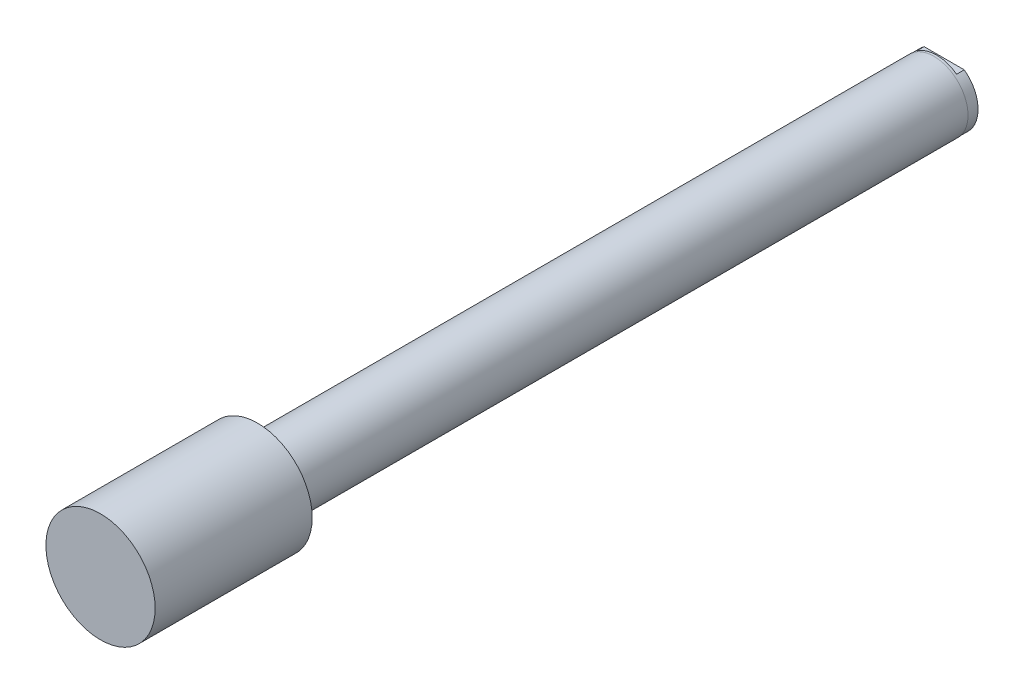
ISO-10303-21;
HEADER;
FILE_DESCRIPTION(('STEP AP214'),'2;1');
FILE_NAME('part.step','',(''),(''),'','','');
FILE_SCHEMA(('AUTOMOTIVE_DESIGN { 1 0 10303 214 1 1 1 1 }'));
ENDSEC;
DATA;
#1=APPLICATION_CONTEXT('core data for automotive mechanical design processes');
#2=APPLICATION_PROTOCOL_DEFINITION('international standard','automotive_design',2000,#1);
#3=PRODUCT_CONTEXT('',#1,'mechanical');
#4=PRODUCT('Part','Part','',(#3));
#5=PRODUCT_RELATED_PRODUCT_CATEGORY('part','',(#4));
#6=PRODUCT_DEFINITION_FORMATION('','',#4);
#7=PRODUCT_DEFINITION_CONTEXT('part definition',#1,'design');
#8=PRODUCT_DEFINITION('design','',#6,#7);
#9=PRODUCT_DEFINITION_SHAPE('','',#8);
#10=(LENGTH_UNIT() NAMED_UNIT(*) SI_UNIT(.MILLI.,.METRE.));
#11=(NAMED_UNIT(*) PLANE_ANGLE_UNIT() SI_UNIT($,.RADIAN.));
#12=(NAMED_UNIT(*) SI_UNIT($,.STERADIAN.) SOLID_ANGLE_UNIT());
#13=UNCERTAINTY_MEASURE_WITH_UNIT(LENGTH_MEASURE(1.E-05),#10,'distance_accuracy_value','');
#14=(GEOMETRIC_REPRESENTATION_CONTEXT(3) GLOBAL_UNCERTAINTY_ASSIGNED_CONTEXT((#13)) GLOBAL_UNIT_ASSIGNED_CONTEXT((#10,
#11,#12)) REPRESENTATION_CONTEXT('',''));
#15=CARTESIAN_POINT('',(0.,0.,0.));
#16=DIRECTION('',(0.,0.,1.));
#17=DIRECTION('',(1.,0.,0.));
#18=AXIS2_PLACEMENT_3D('',#15,#16,#17);
#19=CARTESIAN_POINT('',(0.,0.,27.7368));
#20=DIRECTION('',(0.,0.,-1.));
#21=DIRECTION('',(-1.,0.,0.));
#22=AXIS2_PLACEMENT_3D('',#19,#20,#21);
#23=CONICAL_SURFACE('',#22,4.96062,1.02974425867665);
#24=CARTESIAN_POINT('',(0.,0.,30.7174412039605));
#25=VERTEX_POINT('',#24);
#26=VERTEX_LOOP('',#25);
#27=FACE_BOUND('',#26,.T.);
#28=CARTESIAN_POINT('',(0.,0.,27.7368));
#29=DIRECTION('',(0.,0.,-1.));
#30=DIRECTION('',(-1.,0.,0.));
#31=AXIS2_PLACEMENT_3D('',#28,#29,#30);
#32=CIRCLE('',#31,4.96062);
#33=CARTESIAN_POINT('',(-4.96062,0.,27.7368));
#34=VERTEX_POINT('',#33);
#35=EDGE_CURVE('E93',#34,#34,#32,.T.);
#36=ORIENTED_EDGE('',*,*,#35,.T.);
#37=EDGE_LOOP('',(#36));
#38=FACE_BOUND('',#37,.T.);
#39=ADVANCED_FACE('F16',(#27,#38),#23,.F.);
#40=CARTESIAN_POINT('',(0.,0.,-4.7752));
#41=DIRECTION('',(0.,0.,-1.));
#42=DIRECTION('',(-1.,0.,0.));
#43=AXIS2_PLACEMENT_3D('',#40,#41,#42);
#44=CYLINDRICAL_SURFACE('',#43,4.96062);
#45=ORIENTED_EDGE('',*,*,#35,.F.);
#46=EDGE_LOOP('',(#45));
#47=FACE_BOUND('',#46,.T.);
#48=CARTESIAN_POINT('',(0.,0.,-4.7752));
#49=DIRECTION('',(0.,0.,-1.));
#50=DIRECTION('',(-1.,0.,0.));
#51=AXIS2_PLACEMENT_3D('',#48,#49,#50);
#52=CIRCLE('',#51,4.96062);
#53=CARTESIAN_POINT('',(-4.96062,0.,-4.7752));
#54=VERTEX_POINT('',#53);
#55=EDGE_CURVE('E97',#54,#54,#52,.T.);
#56=ORIENTED_EDGE('',*,*,#55,.T.);
#57=EDGE_LOOP('',(#56));
#58=FACE_BOUND('',#57,.T.);
#59=ADVANCED_FACE('F131',(#47,#58),#44,.F.);
#60=CARTESIAN_POINT('',(0.,0.,-1.2192));
#61=DIRECTION('',(0.,0.,-1.));
#62=DIRECTION('',(-1.,0.,0.));
#63=AXIS2_PLACEMENT_3D('',#60,#61,#62);
#64=PLANE('',#63);
#65=CARTESIAN_POINT('',(0.,0.,-1.2192));
#66=DIRECTION('',(0.,0.,-1.));
#67=DIRECTION('',(-1.,0.,0.));
#68=AXIS2_PLACEMENT_3D('',#65,#66,#67);
#69=CIRCLE('',#68,15.7607);
#70=CARTESIAN_POINT('',(9.33325583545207,-12.7,-1.2192));
#71=VERTEX_POINT('',#70);
#72=CARTESIAN_POINT('',(-9.33325583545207,-12.7,-1.2192));
#73=VERTEX_POINT('',#72);
#74=EDGE_CURVE('E65',#71,#73,#69,.T.);
#75=ORIENTED_EDGE('',*,*,#74,.T.);
#76=DIRECTION('',(1.,0.,0.));
#77=VECTOR('',#76,1.);
#78=CARTESIAN_POINT('',(9.33325583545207,-12.7,-1.2192));
#79=LINE('',#78,#77);
#80=EDGE_CURVE('E67',#73,#71,#79,.T.);
#81=ORIENTED_EDGE('',*,*,#80,.T.);
#82=EDGE_LOOP('',(#75,#81));
#83=FACE_BOUND('',#82,.T.);
#84=ADVANCED_FACE('F66',(#83),#64,.T.);
#85=CARTESIAN_POINT('',(0.,0.,-1.2192));
#86=DIRECTION('',(0.,0.,-1.));
#87=DIRECTION('',(-1.,0.,0.));
#88=AXIS2_PLACEMENT_3D('',#85,#86,#87);
#89=PLANE('',#88);
#90=CARTESIAN_POINT('',(0.,0.,-1.2192));
#91=DIRECTION('',(0.,0.,-1.));
#92=DIRECTION('',(-1.,0.,0.));
#93=AXIS2_PLACEMENT_3D('',#90,#91,#92);
#94=CIRCLE('',#93,15.7607);
#95=CARTESIAN_POINT('',(-9.33325583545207,12.7,-1.2192));
#96=VERTEX_POINT('',#95);
#97=CARTESIAN_POINT('',(9.33325583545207,12.7,-1.2192));
#98=VERTEX_POINT('',#97);
#99=EDGE_CURVE('E85',#96,#98,#94,.T.);
#100=ORIENTED_EDGE('',*,*,#99,.T.);
#101=DIRECTION('',(-1.,0.,0.));
#102=VECTOR('',#101,1.);
#103=CARTESIAN_POINT('',(9.33325583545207,12.7,-1.2192));
#104=LINE('',#103,#102);
#105=EDGE_CURVE('E87',#98,#96,#104,.T.);
#106=ORIENTED_EDGE('',*,*,#105,.T.);
#107=EDGE_LOOP('',(#100,#106));
#108=FACE_BOUND('',#107,.T.);
#109=ADVANCED_FACE('F121',(#108),#89,.T.);
#110=CARTESIAN_POINT('',(9.33325583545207,12.7,-1.2192));
#111=DIRECTION('',(0.,-1.,0.));
#112=DIRECTION('',(0.,0.,1.));
#113=AXIS2_PLACEMENT_3D('',#110,#111,#112);
#114=PLANE('',#113);
#115=DIRECTION('',(-1.,0.,0.));
#116=VECTOR('',#115,1.);
#117=CARTESIAN_POINT('',(9.33325583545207,12.7,-4.7752));
#118=LINE('',#117,#116);
#119=CARTESIAN_POINT('',(9.33325583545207,12.7,-4.7752));
#120=VERTEX_POINT('',#119);
#121=CARTESIAN_POINT('',(-9.33325583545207,12.7,-4.7752));
#122=VERTEX_POINT('',#121);
#123=EDGE_CURVE('E81',#120,#122,#118,.T.);
#124=ORIENTED_EDGE('',*,*,#123,.T.);
#125=DIRECTION('',(0.,0.,-1.));
#126=VECTOR('',#125,1.);
#127=CARTESIAN_POINT('',(-9.33325583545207,12.7,-1.2192));
#128=LINE('',#127,#126);
#129=EDGE_CURVE('E91',#96,#122,#128,.T.);
#130=ORIENTED_EDGE('',*,*,#129,.F.);
#131=ORIENTED_EDGE('',*,*,#105,.F.);
#132=DIRECTION('',(0.,0.,-1.));
#133=VECTOR('',#132,1.);
#134=CARTESIAN_POINT('',(9.33325583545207,12.7,-1.2192));
#135=LINE('',#134,#133);
#136=EDGE_CURVE('E41',#98,#120,#135,.T.);
#137=ORIENTED_EDGE('',*,*,#136,.T.);
#138=EDGE_LOOP('',(#124,#130,#131,#137));
#139=FACE_BOUND('',#138,.T.);
#140=ADVANCED_FACE('F118',(#139),#114,.F.);
#141=CARTESIAN_POINT('',(0.,0.,-4.7752));
#142=DIRECTION('',(0.,0.,-1.));
#143=DIRECTION('',(-1.,0.,0.));
#144=AXIS2_PLACEMENT_3D('',#141,#142,#143);
#145=PLANE('',#144);
#146=DIRECTION('',(1.,0.,0.));
#147=VECTOR('',#146,1.);
#148=CARTESIAN_POINT('',(9.33325583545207,-12.7,-4.7752));
#149=LINE('',#148,#147);
#150=CARTESIAN_POINT('',(-9.33325583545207,-12.7,-4.7752));
#151=VERTEX_POINT('',#150);
#152=CARTESIAN_POINT('',(9.33325583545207,-12.7,-4.7752));
#153=VERTEX_POINT('',#152);
#154=EDGE_CURVE('E70',#151,#153,#149,.T.);
#155=ORIENTED_EDGE('',*,*,#154,.F.);
#156=CARTESIAN_POINT('',(0.,0.,-4.7752));
#157=DIRECTION('',(0.,0.,-1.));
#158=DIRECTION('',(-1.,0.,0.));
#159=AXIS2_PLACEMENT_3D('',#156,#157,#158);
#160=CIRCLE('',#159,15.7607);
#161=EDGE_CURVE('E79',#151,#122,#160,.T.);
#162=ORIENTED_EDGE('',*,*,#161,.T.);
#163=ORIENTED_EDGE('',*,*,#123,.F.);
#164=EDGE_CURVE('E25',#120,#153,#160,.T.);
#165=ORIENTED_EDGE('',*,*,#164,.T.);
#166=EDGE_LOOP('',(#155,#162,#163,#165));
#167=FACE_BOUND('',#166,.T.);
#168=ORIENTED_EDGE('',*,*,#55,.F.);
#169=EDGE_LOOP('',(#168));
#170=FACE_BOUND('',#169,.T.);
#171=ADVANCED_FACE('F116',(#167,#170),#145,.T.);
#172=CARTESIAN_POINT('',(9.33325583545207,-12.7,-1.2192));
#173=DIRECTION('',(0.,1.,0.));
#174=DIRECTION('',(0.,0.,-1.));
#175=AXIS2_PLACEMENT_3D('',#172,#173,#174);
#176=PLANE('',#175);
#177=ORIENTED_EDGE('',*,*,#154,.T.);
#178=DIRECTION('',(0.,0.,-1.));
#179=VECTOR('',#178,1.);
#180=CARTESIAN_POINT('',(9.33325583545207,-12.7,-1.2192));
#181=LINE('',#180,#179);
#182=EDGE_CURVE('E73',#71,#153,#181,.T.);
#183=ORIENTED_EDGE('',*,*,#182,.F.);
#184=ORIENTED_EDGE('',*,*,#80,.F.);
#185=DIRECTION('',(0.,0.,-1.));
#186=VECTOR('',#185,1.);
#187=CARTESIAN_POINT('',(-9.33325583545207,-12.7,-1.2192));
#188=LINE('',#187,#186);
#189=EDGE_CURVE('E33',#73,#151,#188,.T.);
#190=ORIENTED_EDGE('',*,*,#189,.T.);
#191=EDGE_LOOP('',(#177,#183,#184,#190));
#192=FACE_BOUND('',#191,.T.);
#193=ADVANCED_FACE('F72',(#192),#176,.F.);
#194=CARTESIAN_POINT('',(0.,0.,0.));
#195=DIRECTION('',(0.,0.,-1.));
#196=DIRECTION('',(-1.,0.,0.));
#197=AXIS2_PLACEMENT_3D('',#194,#195,#196);
#198=CYLINDRICAL_SURFACE('',#197,15.7607);
#199=ORIENTED_EDGE('',*,*,#182,.T.);
#200=ORIENTED_EDGE('',*,*,#164,.F.);
#201=ORIENTED_EDGE('',*,*,#136,.F.);
#202=ORIENTED_EDGE('',*,*,#99,.F.);
#203=ORIENTED_EDGE('',*,*,#129,.T.);
#204=ORIENTED_EDGE('',*,*,#161,.F.);
#205=ORIENTED_EDGE('',*,*,#189,.F.);
#206=ORIENTED_EDGE('',*,*,#74,.F.);
#207=EDGE_LOOP('',(#199,#200,#201,#202,#203,#204,#205,#206));
#208=FACE_BOUND('',#207,.T.);
#209=CARTESIAN_POINT('',(0.,0.,0.));
#210=DIRECTION('',(0.,0.,-1.));
#211=DIRECTION('',(-1.,0.,0.));
#212=AXIS2_PLACEMENT_3D('',#209,#210,#211);
#213=CIRCLE('',#212,15.7607);
#214=CARTESIAN_POINT('',(-15.7607,0.,0.));
#215=VERTEX_POINT('',#214);
#216=EDGE_CURVE('E10',#215,#215,#213,.T.);
#217=ORIENTED_EDGE('',*,*,#216,.T.);
#218=EDGE_LOOP('',(#217));
#219=FACE_BOUND('',#218,.T.);
#220=ADVANCED_FACE('F76',(#208,#219),#198,.T.);
#221=CARTESIAN_POINT('',(0.,0.,387.5024));
#222=DIRECTION('',(0.,0.,1.));
#223=DIRECTION('',(1.,0.,0.));
#224=AXIS2_PLACEMENT_3D('',#221,#222,#223);
#225=PLANE('',#224);
#226=CARTESIAN_POINT('',(0.,0.,387.5024));
#227=DIRECTION('',(0.,0.,1.));
#228=DIRECTION('',(1.,0.,0.));
#229=AXIS2_PLACEMENT_3D('',#226,#227,#228);
#230=CIRCLE('',#229,25.4);
#231=CARTESIAN_POINT('',(25.4,0.,387.5024));
#232=VERTEX_POINT('',#231);
#233=EDGE_CURVE('E102',#232,#232,#230,.T.);
#234=ORIENTED_EDGE('',*,*,#233,.T.);
#235=EDGE_LOOP('',(#234));
#236=FACE_BOUND('',#235,.T.);
#237=ADVANCED_FACE('F149',(#236),#225,.T.);
#238=CARTESIAN_POINT('',(0.,0.,387.5024));
#239=DIRECTION('',(0.,0.,-1.));
#240=DIRECTION('',(-1.,0.,0.));
#241=AXIS2_PLACEMENT_3D('',#238,#239,#240);
#242=CYLINDRICAL_SURFACE('',#241,25.4);
#243=ORIENTED_EDGE('',*,*,#233,.F.);
#244=EDGE_LOOP('',(#243));
#245=FACE_BOUND('',#244,.T.);
#246=CARTESIAN_POINT('',(0.,0.,314.4774));
#247=DIRECTION('',(0.,0.,1.));
#248=DIRECTION('',(1.,0.,0.));
#249=AXIS2_PLACEMENT_3D('',#246,#247,#248);
#250=CIRCLE('',#249,25.4);
#251=CARTESIAN_POINT('',(25.4,0.,314.4774));
#252=VERTEX_POINT('',#251);
#253=EDGE_CURVE('E106',#252,#252,#250,.T.);
#254=ORIENTED_EDGE('',*,*,#253,.T.);
#255=EDGE_LOOP('',(#254));
#256=FACE_BOUND('',#255,.T.);
#257=ADVANCED_FACE('F152',(#245,#256),#242,.T.);
#258=CARTESIAN_POINT('',(0.,0.,314.4774));
#259=DIRECTION('',(0.,0.,1.));
#260=DIRECTION('',(1.,0.,0.));
#261=AXIS2_PLACEMENT_3D('',#258,#259,#260);
#262=PLANE('',#261);
#263=CARTESIAN_POINT('',(0.,0.,314.4774));
#264=DIRECTION('',(0.,0.,1.));
#265=DIRECTION('',(1.,0.,0.));
#266=AXIS2_PLACEMENT_3D('',#263,#264,#265);
#267=CIRCLE('',#266,15.875);
#268=CARTESIAN_POINT('',(15.875,0.,314.4774));
#269=VERTEX_POINT('',#268);
#270=EDGE_CURVE('E105',#269,#269,#267,.F.);
#271=ORIENTED_EDGE('',*,*,#270,.F.);
#272=EDGE_LOOP('',(#271));
#273=FACE_BOUND('',#272,.T.);
#274=ORIENTED_EDGE('',*,*,#253,.F.);
#275=EDGE_LOOP('',(#274));
#276=FACE_BOUND('',#275,.T.);
#277=ADVANCED_FACE('F154',(#273,#276),#262,.F.);
#278=CARTESIAN_POINT('',(0.,0.,314.4774));
#279=DIRECTION('',(0.,0.,-1.));
#280=DIRECTION('',(-1.,0.,0.));
#281=AXIS2_PLACEMENT_3D('',#278,#279,#280);
#282=CYLINDRICAL_SURFACE('',#281,15.875);
#283=CARTESIAN_POINT('',(0.,0.,0.));
#284=DIRECTION('',(0.,0.,-1.));
#285=DIRECTION('',(-1.,0.,0.));
#286=AXIS2_PLACEMENT_3D('',#283,#284,#285);
#287=CIRCLE('',#286,15.875);
#288=CARTESIAN_POINT('',(-15.875,0.,0.));
#289=VERTEX_POINT('',#288);
#290=EDGE_CURVE('E20',#289,#289,#287,.T.);
#291=ORIENTED_EDGE('',*,*,#290,.F.);
#292=EDGE_LOOP('',(#291));
#293=FACE_BOUND('',#292,.T.);
#294=ORIENTED_EDGE('',*,*,#270,.T.);
#295=EDGE_LOOP('',(#294));
#296=FACE_BOUND('',#295,.T.);
#297=ADVANCED_FACE('F18',(#293,#296),#282,.T.);
#298=CARTESIAN_POINT('',(0.,0.,0.));
#299=DIRECTION('',(0.,0.,-1.));
#300=DIRECTION('',(-1.,0.,0.));
#301=AXIS2_PLACEMENT_3D('',#298,#299,#300);
#302=PLANE('',#301);
#303=ORIENTED_EDGE('',*,*,#290,.T.);
#304=EDGE_LOOP('',(#303));
#305=FACE_BOUND('',#304,.T.);
#306=ORIENTED_EDGE('',*,*,#216,.F.);
#307=EDGE_LOOP('',(#306));
#308=FACE_BOUND('',#307,.T.);
#309=ADVANCED_FACE('F158',(#305,#308),#302,.T.);
#310=CLOSED_SHELL('',(#39,#59,#84,#109,#140,#171,#193,#220,#237,#257,#277,#297,#309));
#311=MANIFOLD_SOLID_BREP('B1',#310);
#312=ADVANCED_BREP_SHAPE_REPRESENTATION('',(#18,#311),#14);
#313=SHAPE_DEFINITION_REPRESENTATION(#9,#312);
ENDSEC;
END-ISO-10303-21;
